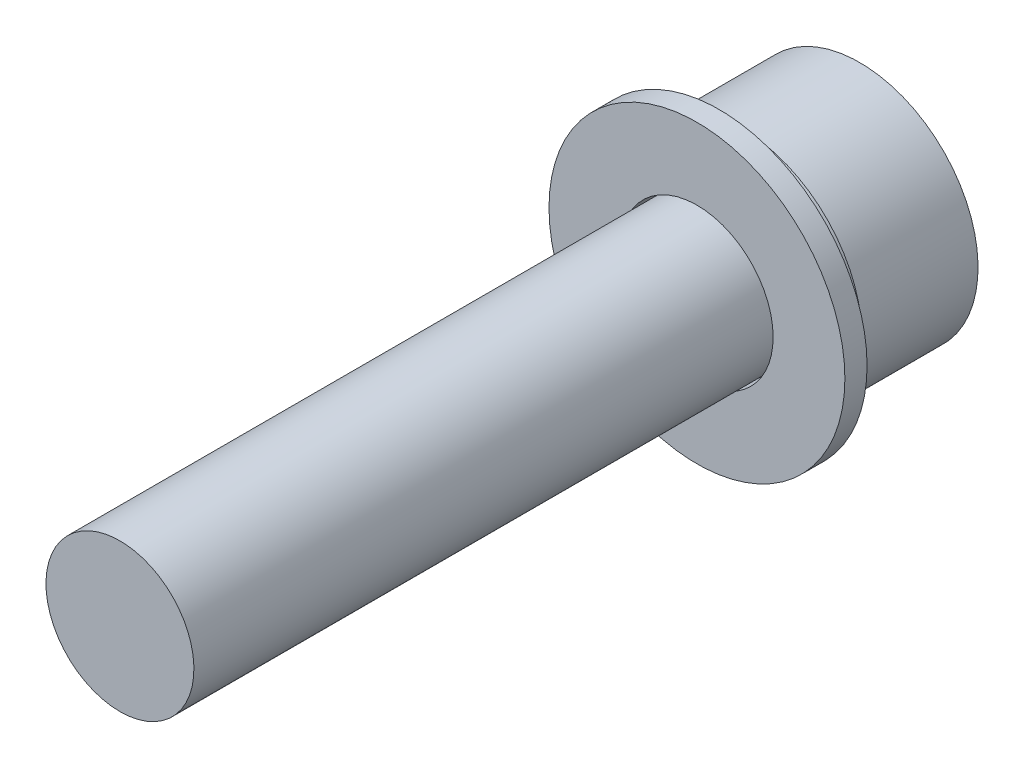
from build123d import *

# Parameters (mm, degrees)
CUT_EXTRUDE1_DEPTH  = 3
BOSS_EXTRUDE1_DEPTH = 1.5
SKETCH4_R           = 10
SKETCH4_R_2         = 5.15
BOSS_EXTRUDE2_DEPTH = 1.5


with BuildPart() as part:
    # Sketch1 → Revolve1 (revolve)
    with BuildSketch(Plane(origin=(0, 0, 0), x_dir=(0, 0, -1), z_dir=(1, 0, 0)), mode=Mode.PRIVATE) as revolve1_sk:
        Polygon((-25, 0), (25, 0), (25, 8), (17, 8), (17, 5), (-25, 5), align=None)
    revolve(revolve1_sk.sketch.rotate(Axis((0, 0, 25), (0, 0, -1)), 180), axis=Axis((0, 0, 25), (0, 0, -1)))

    # Sketch2 → Cut-Extrude1 (cut)
    with BuildSketch(Plane(origin=(0, 0, -25), x_dir=(-1, 0, 0), z_dir=(0, 0, -1))):
        Polygon((0, 5), (4.330127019, 2.5), (4.330127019, -2.5), (0, -5), (-4.330127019, -2.5), (-4.330127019, 2.5), align=None)
    extrude(amount=-CUT_EXTRUDE1_DEPTH, mode=Mode.SUBTRACT)



with BuildPart() as body_2:
    # Sketch3 → Boss-Extrude1 (new body)
    with BuildSketch(Plane.XY.offset(-17)):
        with BuildLine():
            Line((3.143589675, -4.07925777), (4.974806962, -6.455524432))
            ThreePointArc((4.974806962, -6.455524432), (-4.632675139, 6.705283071), (4.278028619, -6.936928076))
            Line((4.278028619, -6.936928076), (2.703294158, -4.383457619))
            ThreePointArc((2.703294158, -4.383457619), (-2.927395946, 4.237080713), (3.143589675, -4.07925777))
        make_face()
    extrude(amount=BOSS_EXTRUDE1_DEPTH)


with BuildPart() as part_1:
    add(part.part)

    add(body_2.part)  # Boss-Extrude2 merges body 2
    # Sketch4 → Boss-Extrude2 (add)
    with BuildSketch(Plane.XY.offset(-15.5)):
        Circle(SKETCH4_R)
        with Locations(Location((0, 0, 0), (0, 0, 301.662284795))):
            Circle(SKETCH4_R_2, mode=Mode.SUBTRACT)
    extrude(amount=BOSS_EXTRUDE2_DEPTH)


solid = part_1.part
